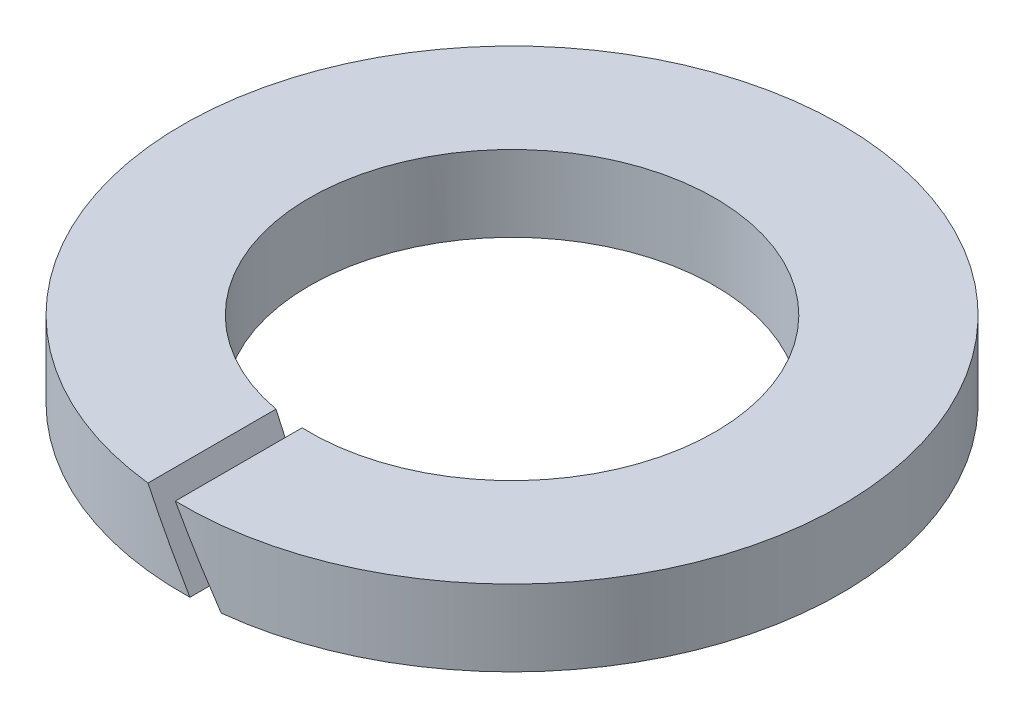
from build123d import *

# Parameters (mm, degrees)
SECTION_2_W      = 2
SECTION_2_H      = 1.2
FENTE_REACH      = 9.451
FENTE_END_RADIUS = 5.2


with BuildPart() as part:
    # section 2 → R_volution (revolve)
    with BuildSketch(Plane.XY, mode=Mode.PRIVATE) as r_volution_sk:
        with Locations((4.2, 0)):
            Rectangle(SECTION_2_W, SECTION_2_H)
    revolve(r_volution_sk.sketch.rotate(Axis((0, 80, 0), (0, -1, 0)), 90), axis=Axis((0, 80, 0), (0, -1, 0)))

    # fente: up to this cylinder (the profile starts inside it)
    fente_end = Plane(origin=(0, 0, 0), z_dir=(0, 1, 0)) * Cylinder(FENTE_END_RADIUS, 30.302, mode=Mode.PRIVATE)
    # Sketch2 → fente (cut, up to the surface)
    with BuildSketch(Plane(origin=(0, 0.6, 0), x_dir=(-1, 0, 0), z_dir=(0, 0, -1)), mode=Mode.PRIVATE) as fente_sk1:
        Polygon((-0.577350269, -1.2), (0.115470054, 0), (0.577350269, 0), (-0.115470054, -1.2), align=None)
    fente_tool1 = extrude(fente_sk1.sketch, amount=-FENTE_REACH, mode=Mode.PRIVATE) & fente_end
    add(fente_tool1.solids().sort_by_distance((0, 0, 0))[0], mode=Mode.SUBTRACT)


solid = part.part
